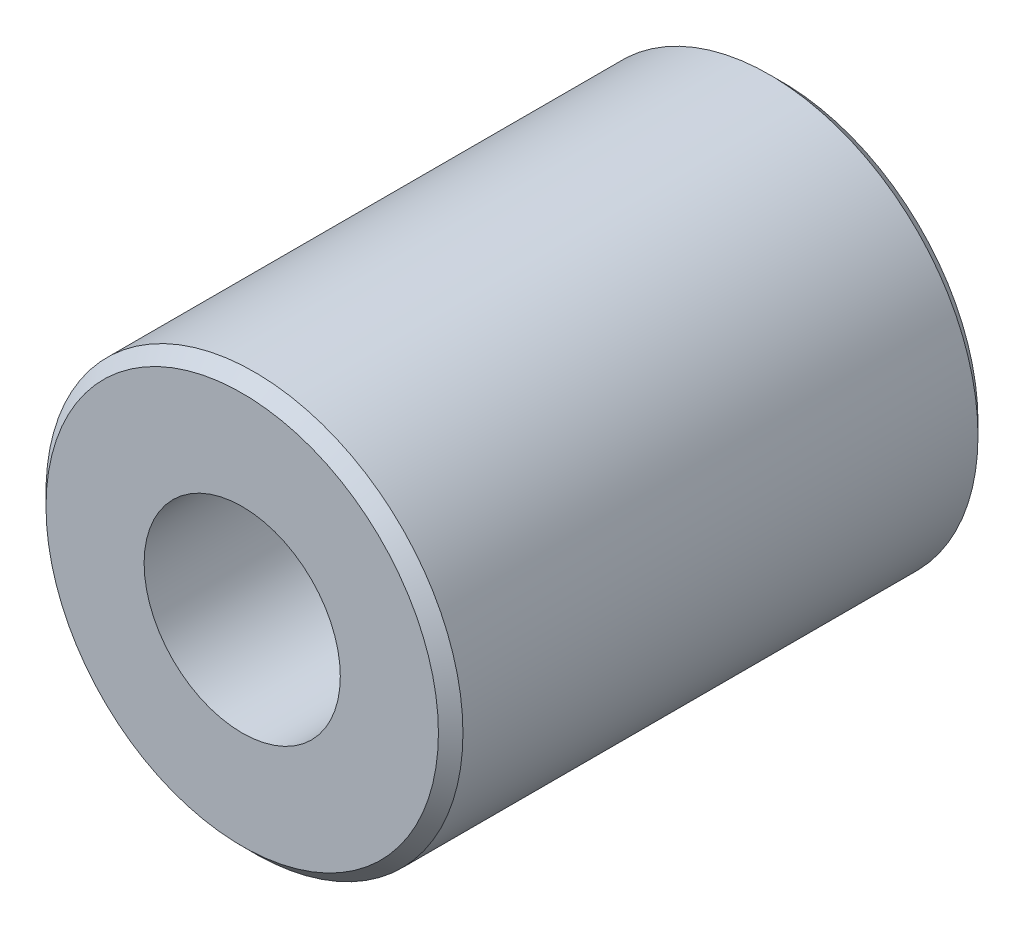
ISO-10303-21;
HEADER;
FILE_DESCRIPTION(('STEP AP214'),'2;1');
FILE_NAME('part.step','',(''),(''),'','','');
FILE_SCHEMA(('AUTOMOTIVE_DESIGN { 1 0 10303 214 1 1 1 1 }'));
ENDSEC;
DATA;
#1=APPLICATION_CONTEXT('core data for automotive mechanical design processes');
#2=APPLICATION_PROTOCOL_DEFINITION('international standard','automotive_design',2000,#1);
#3=PRODUCT_CONTEXT('',#1,'mechanical');
#4=PRODUCT('Part','Part','',(#3));
#5=PRODUCT_RELATED_PRODUCT_CATEGORY('part','',(#4));
#6=PRODUCT_DEFINITION_FORMATION('','',#4);
#7=PRODUCT_DEFINITION_CONTEXT('part definition',#1,'design');
#8=PRODUCT_DEFINITION('design','',#6,#7);
#9=PRODUCT_DEFINITION_SHAPE('','',#8);
#10=(LENGTH_UNIT() NAMED_UNIT(*) SI_UNIT(.MILLI.,.METRE.));
#11=(NAMED_UNIT(*) PLANE_ANGLE_UNIT() SI_UNIT($,.RADIAN.));
#12=(NAMED_UNIT(*) SI_UNIT($,.STERADIAN.) SOLID_ANGLE_UNIT());
#13=UNCERTAINTY_MEASURE_WITH_UNIT(LENGTH_MEASURE(1.E-05),#10,'distance_accuracy_value','');
#14=(GEOMETRIC_REPRESENTATION_CONTEXT(3) GLOBAL_UNCERTAINTY_ASSIGNED_CONTEXT((#13)) GLOBAL_UNIT_ASSIGNED_CONTEXT((#10,
#11,#12)) REPRESENTATION_CONTEXT('',''));
#15=CARTESIAN_POINT('',(0.,0.,0.));
#16=DIRECTION('',(0.,0.,1.));
#17=DIRECTION('',(1.,0.,0.));
#18=AXIS2_PLACEMENT_3D('',#15,#16,#17);
#19=CARTESIAN_POINT('',(0.,0.,11.));
#20=DIRECTION('',(0.,0.,1.));
#21=DIRECTION('',(1.,0.,0.));
#22=AXIS2_PLACEMENT_3D('',#19,#20,#21);
#23=PLANE('',#22);
#24=CARTESIAN_POINT('',(0.,0.,11.));
#25=DIRECTION('',(0.,0.,1.));
#26=DIRECTION('',(1.,0.,0.));
#27=AXIS2_PLACEMENT_3D('',#24,#25,#26);
#28=CIRCLE('',#27,4.);
#29=CARTESIAN_POINT('',(4.,0.,11.));
#30=VERTEX_POINT('',#29);
#31=EDGE_CURVE('E10',#30,#30,#28,.T.);
#32=ORIENTED_EDGE('',*,*,#31,.T.);
#33=EDGE_LOOP('',(#32));
#34=FACE_BOUND('',#33,.T.);
#35=CARTESIAN_POINT('',(0.,0.,11.));
#36=DIRECTION('',(0.,0.,1.));
#37=DIRECTION('',(1.,0.,0.));
#38=AXIS2_PLACEMENT_3D('',#35,#36,#37);
#39=CIRCLE('',#38,2.);
#40=CARTESIAN_POINT('',(2.,0.,11.));
#41=VERTEX_POINT('',#40);
#42=EDGE_CURVE('E44',#41,#41,#39,.T.);
#43=ORIENTED_EDGE('',*,*,#42,.F.);
#44=EDGE_LOOP('',(#43));
#45=FACE_BOUND('',#44,.T.);
#46=ADVANCED_FACE('F24',(#34,#45),#23,.T.);
#47=CARTESIAN_POINT('',(0.,0.,0.));
#48=DIRECTION('',(0.,0.,1.));
#49=DIRECTION('',(1.,0.,0.));
#50=AXIS2_PLACEMENT_3D('',#47,#48,#49);
#51=PLANE('',#50);
#52=CARTESIAN_POINT('',(0.,0.,0.));
#53=DIRECTION('',(0.,0.,1.));
#54=DIRECTION('',(1.,0.,0.));
#55=AXIS2_PLACEMENT_3D('',#52,#53,#54);
#56=CIRCLE('',#55,4.);
#57=CARTESIAN_POINT('',(4.,0.,0.));
#58=VERTEX_POINT('',#57);
#59=EDGE_CURVE('E31',#58,#58,#56,.F.);
#60=ORIENTED_EDGE('',*,*,#59,.T.);
#61=EDGE_LOOP('',(#60));
#62=FACE_BOUND('',#61,.T.);
#63=CARTESIAN_POINT('',(0.,0.,0.));
#64=DIRECTION('',(0.,0.,1.));
#65=DIRECTION('',(1.,0.,0.));
#66=AXIS2_PLACEMENT_3D('',#63,#64,#65);
#67=CIRCLE('',#66,2.);
#68=CARTESIAN_POINT('',(2.,0.,0.));
#69=VERTEX_POINT('',#68);
#70=EDGE_CURVE('E47',#69,#69,#67,.T.);
#71=ORIENTED_EDGE('',*,*,#70,.T.);
#72=EDGE_LOOP('',(#71));
#73=FACE_BOUND('',#72,.T.);
#74=ADVANCED_FACE('F51',(#62,#73),#51,.F.);
#75=CARTESIAN_POINT('',(0.,0.,11.));
#76=DIRECTION('',(0.,0.,-1.));
#77=DIRECTION('',(-1.,0.,0.));
#78=AXIS2_PLACEMENT_3D('',#75,#76,#77);
#79=CYLINDRICAL_SURFACE('',#78,4.25);
#80=CARTESIAN_POINT('',(0.,0.,0.25));
#81=DIRECTION('',(0.,0.,1.));
#82=DIRECTION('',(1.,0.,0.));
#83=AXIS2_PLACEMENT_3D('',#80,#81,#82);
#84=CIRCLE('',#83,4.25);
#85=CARTESIAN_POINT('',(4.25,0.,0.25));
#86=VERTEX_POINT('',#85);
#87=EDGE_CURVE('E35',#86,#86,#84,.T.);
#88=ORIENTED_EDGE('',*,*,#87,.T.);
#89=EDGE_LOOP('',(#88));
#90=FACE_BOUND('',#89,.T.);
#91=CARTESIAN_POINT('',(0.,0.,10.75));
#92=DIRECTION('',(0.,0.,1.));
#93=DIRECTION('',(1.,0.,0.));
#94=AXIS2_PLACEMENT_3D('',#91,#92,#93);
#95=CIRCLE('',#94,4.25);
#96=CARTESIAN_POINT('',(4.25,0.,10.75));
#97=VERTEX_POINT('',#96);
#98=EDGE_CURVE('E39',#97,#97,#95,.F.);
#99=ORIENTED_EDGE('',*,*,#98,.T.);
#100=EDGE_LOOP('',(#99));
#101=FACE_BOUND('',#100,.T.);
#102=ADVANCED_FACE('F26',(#90,#101),#79,.T.);
#103=CARTESIAN_POINT('',(0.,0.,11.));
#104=DIRECTION('',(0.,0.,-1.));
#105=DIRECTION('',(-1.,0.,0.));
#106=AXIS2_PLACEMENT_3D('',#103,#104,#105);
#107=CYLINDRICAL_SURFACE('',#106,2.);
#108=ORIENTED_EDGE('',*,*,#42,.T.);
#109=EDGE_LOOP('',(#108));
#110=FACE_BOUND('',#109,.T.);
#111=ORIENTED_EDGE('',*,*,#70,.F.);
#112=EDGE_LOOP('',(#111));
#113=FACE_BOUND('',#112,.T.);
#114=ADVANCED_FACE('F53',(#110,#113),#107,.F.);
#115=CARTESIAN_POINT('',(0.,0.,0.25));
#116=DIRECTION('',(0.,0.,1.));
#117=DIRECTION('',(1.,0.,0.));
#118=AXIS2_PLACEMENT_3D('',#115,#116,#117);
#119=CONICAL_SURFACE('',#118,4.25,0.785398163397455);
#120=ORIENTED_EDGE('',*,*,#59,.F.);
#121=EDGE_LOOP('',(#120));
#122=FACE_BOUND('',#121,.T.);
#123=ORIENTED_EDGE('',*,*,#87,.F.);
#124=EDGE_LOOP('',(#123));
#125=FACE_BOUND('',#124,.T.);
#126=ADVANCED_FACE('F55',(#122,#125),#119,.T.);
#127=CARTESIAN_POINT('',(0.,0.,11.));
#128=DIRECTION('',(0.,0.,-1.));
#129=DIRECTION('',(-1.,0.,0.));
#130=AXIS2_PLACEMENT_3D('',#127,#128,#129);
#131=CONICAL_SURFACE('',#130,4.,0.785398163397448);
#132=ORIENTED_EDGE('',*,*,#98,.F.);
#133=EDGE_LOOP('',(#132));
#134=FACE_BOUND('',#133,.T.);
#135=ORIENTED_EDGE('',*,*,#31,.F.);
#136=EDGE_LOOP('',(#135));
#137=FACE_BOUND('',#136,.T.);
#138=ADVANCED_FACE('F62',(#134,#137),#131,.T.);
#139=CLOSED_SHELL('',(#46,#74,#102,#114,#126,#138));
#140=MANIFOLD_SOLID_BREP('B2',#139);
#141=ADVANCED_BREP_SHAPE_REPRESENTATION('',(#18,#140),#14);
#142=SHAPE_DEFINITION_REPRESENTATION(#9,#141);
ENDSEC;
END-ISO-10303-21;
